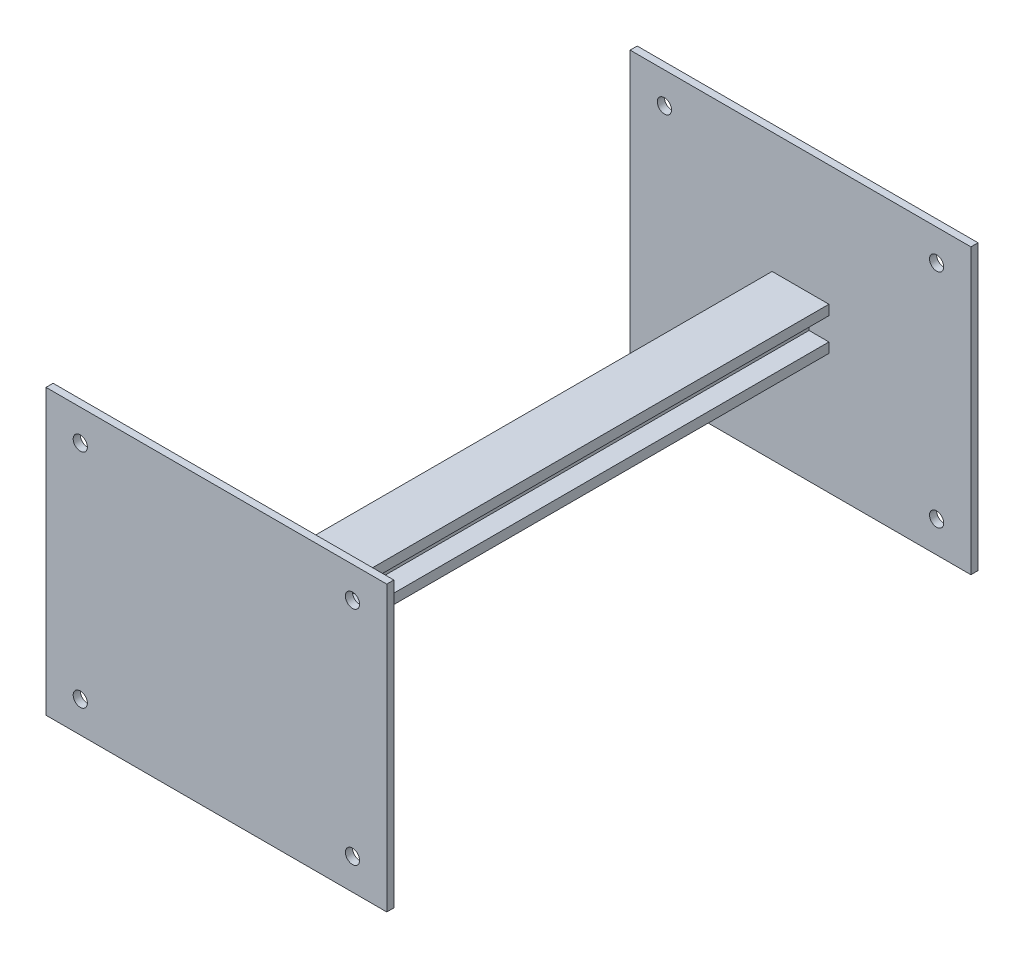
from build123d import *

# Parameters (mm, degrees)
BOSS_EXTRUDE1_DEPTH = 516.128
SKETCH2_W           = 304.8
SKETCH2_H           = 254
BOSS_EXTRUDE3_DEPTH = 6.35
SKETCH3_W           = 304.8
SKETCH3_H           = 254
BOSS_EXTRUDE4_DEPTH = 6.35
SKETCH4_R           = 6.35
CUT_EXTRUDE1_DEPTH  = 565.813078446


with BuildPart() as part:
    # Sketch1 → Boss-Extrude1 (new body)
    with BuildSketch(Plane.XY):
        Polygon((-7.62, 10.16), (-25.4, 10.16), (-25.4, 19.05), (25.4, 19.05), (25.4, 10.16), (7.62, 10.16), (7.62, -10.16), (25.4, -10.16), (25.4, -19.05), (-25.4, -19.05), (-25.4, -10.16), (-7.62, -10.16), align=None)
    extrude(amount=BOSS_EXTRUDE1_DEPTH)


with BuildPart() as body_2:
    # Sketch2 → Boss-Extrude3 (new body)
    with BuildSketch(Plane.XY.offset(516.128)):
        Rectangle(SKETCH2_W, SKETCH2_H)
    extrude(amount=BOSS_EXTRUDE3_DEPTH)


with BuildPart() as body_3:
    # Sketch3 → Boss-Extrude4 (new body)
    with BuildSketch(Plane(origin=(0, 0, 0), x_dir=(-1, 0, 0), z_dir=(0, 0, -1))):
        Rectangle(SKETCH3_W, SKETCH3_H)
    extrude(amount=BOSS_EXTRUDE4_DEPTH)


with BuildPart() as cut_extrude1_tool:
    # Sketch4 → Cut-Extrude1 (new, through all)
    with BuildSketch(Plane.XY.offset(522.478)):
        with Locations((121.732744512, 99.191393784)):
            Circle(SKETCH4_R)
        with Locations(Location((121.732744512, -99.191393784, 0), (0, 0, 180))):
            Circle(SKETCH4_R)
        with Locations((-121.732744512, -99.191393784)):
            Circle(SKETCH4_R)
        with Locations(Location((-121.732744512, 99.191393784, 0), (0, 0, 180))):
            Circle(SKETCH4_R)
    extrude(amount=-CUT_EXTRUDE1_DEPTH)


with BuildPart() as body_2_1:
    add(body_2.part)

    # Cut-Extrude1: cut by cut_extrude1_tool
    add(cut_extrude1_tool.part, mode=Mode.SUBTRACT)


with BuildPart() as body_3_1:
    add(body_3.part)

    # Cut-Extrude1: cut by cut_extrude1_tool
    add(cut_extrude1_tool.part, mode=Mode.SUBTRACT)


solid = Compound([part.part, body_2_1.part, body_3_1.part])
